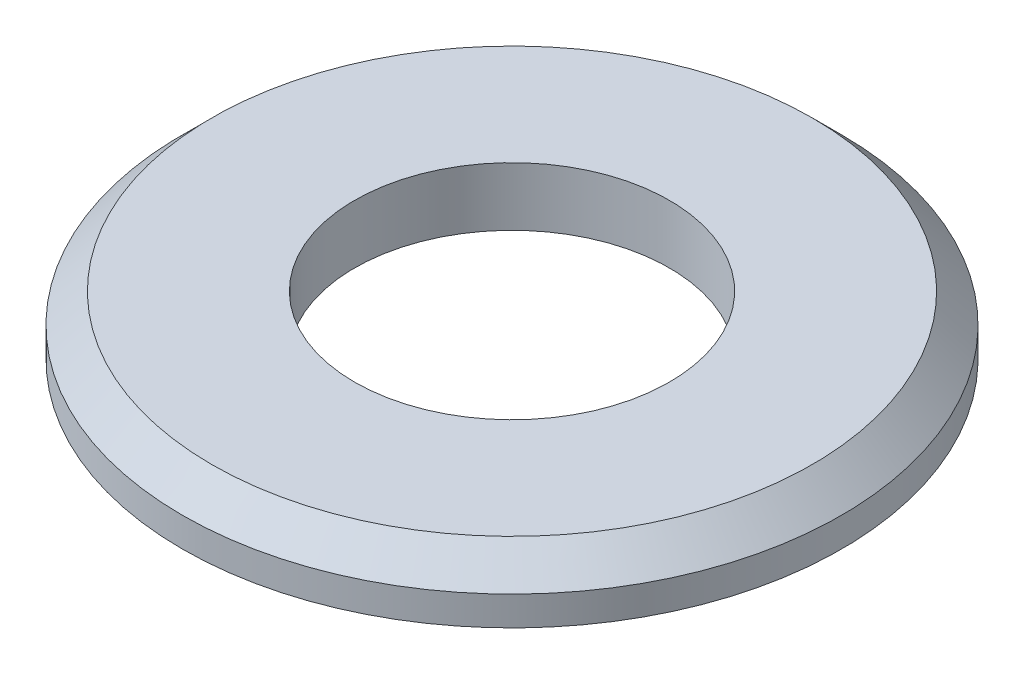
from build123d import *

# Parameters (mm, degrees)
SKETCH1_R      = 4.5
SKETCH1_R_2    = 2.15
EXTRUDE1_DEPTH = 0.8
CHAMFER1_SIZE  = 0.4


with BuildPart() as part:
    # Sketch1 → Extrude1 (new body)
    with BuildSketch(Plane(origin=(0, 0, 0), x_dir=(1, 0, 0), z_dir=(0, 1, 0))):
        with Locations(Location((0, 0, 0), (0, 0, 270))):
            Circle(SKETCH1_R)
        with Locations(Location((0, 0, 0), (0, 0, 270))):
            Circle(SKETCH1_R_2, mode=Mode.SUBTRACT)
    extrude(amount=EXTRUDE1_DEPTH)

    # Chamfer1
    chamfer1_edges = [part.edges().sort_by_distance(p)[0] for p in [
        (0, 0.8, -4.5),
    ]]
    chamfer(chamfer1_edges, length=CHAMFER1_SIZE)


solid = part.part
